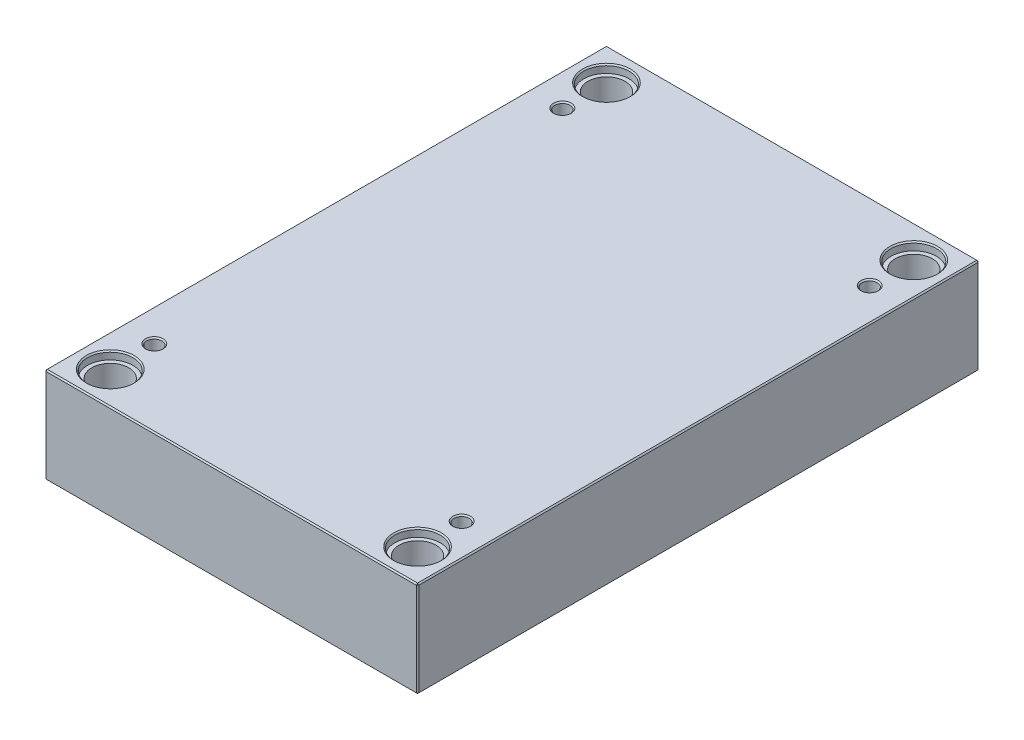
ISO-10303-21;
HEADER;
FILE_DESCRIPTION(('STEP AP214'),'2;1');
FILE_NAME('part.step','',(''),(''),'','','');
FILE_SCHEMA(('AUTOMOTIVE_DESIGN { 1 0 10303 214 1 1 1 1 }'));
ENDSEC;
DATA;
#1=APPLICATION_CONTEXT('core data for automotive mechanical design processes');
#2=APPLICATION_PROTOCOL_DEFINITION('international standard','automotive_design',2000,#1);
#3=PRODUCT_CONTEXT('',#1,'mechanical');
#4=PRODUCT('Part','Part','',(#3));
#5=PRODUCT_RELATED_PRODUCT_CATEGORY('part','',(#4));
#6=PRODUCT_DEFINITION_FORMATION('','',#4);
#7=PRODUCT_DEFINITION_CONTEXT('part definition',#1,'design');
#8=PRODUCT_DEFINITION('design','',#6,#7);
#9=PRODUCT_DEFINITION_SHAPE('','',#8);
#10=(LENGTH_UNIT() NAMED_UNIT(*) SI_UNIT(.MILLI.,.METRE.));
#11=(NAMED_UNIT(*) PLANE_ANGLE_UNIT() SI_UNIT($,.RADIAN.));
#12=(NAMED_UNIT(*) SI_UNIT($,.STERADIAN.) SOLID_ANGLE_UNIT());
#13=UNCERTAINTY_MEASURE_WITH_UNIT(LENGTH_MEASURE(1.E-05),#10,'distance_accuracy_value','');
#14=(GEOMETRIC_REPRESENTATION_CONTEXT(3) GLOBAL_UNCERTAINTY_ASSIGNED_CONTEXT((#13)) GLOBAL_UNIT_ASSIGNED_CONTEXT((#10,
#11,#12)) REPRESENTATION_CONTEXT('',''));
#15=CARTESIAN_POINT('',(0.,0.,0.));
#16=DIRECTION('',(0.,0.,1.));
#17=DIRECTION('',(1.,0.,0.));
#18=AXIS2_PLACEMENT_3D('',#15,#16,#17);
#19=CARTESIAN_POINT('',(-122.,0.,-197.));
#20=DIRECTION('',(0.,1.,0.));
#21=DIRECTION('',(0.,0.,1.));
#22=AXIS2_PLACEMENT_3D('',#19,#20,#21);
#23=CYLINDRICAL_SURFACE('',#22,14.7);
#24=CARTESIAN_POINT('',(-122.,1.00000000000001,-197.));
#25=DIRECTION('',(0.,1.,0.));
#26=DIRECTION('',(0.,0.,1.));
#27=AXIS2_PLACEMENT_3D('',#24,#25,#26);
#28=CIRCLE('',#27,14.7);
#29=CARTESIAN_POINT('',(-122.,1.00000000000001,-182.3));
#30=VERTEX_POINT('',#29);
#31=EDGE_CURVE('E472',#30,#30,#28,.F.);
#32=ORIENTED_EDGE('',*,*,#31,.T.);
#33=EDGE_LOOP('',(#32));
#34=FACE_BOUND('',#33,.T.);
#35=CARTESIAN_POINT('',(-122.,69.7,-197.));
#36=DIRECTION('',(0.,1.,0.));
#37=DIRECTION('',(0.,0.,1.));
#38=AXIS2_PLACEMENT_3D('',#35,#36,#37);
#39=CIRCLE('',#38,14.7);
#40=CARTESIAN_POINT('',(-122.,69.7,-182.3));
#41=VERTEX_POINT('',#40);
#42=EDGE_CURVE('E221',#41,#41,#39,.F.);
#43=ORIENTED_EDGE('',*,*,#42,.F.);
#44=EDGE_LOOP('',(#43));
#45=FACE_BOUND('',#44,.T.);
#46=ADVANCED_FACE('F16',(#34,#45),#23,.F.);
#47=CARTESIAN_POINT('',(122.,0.,-197.));
#48=DIRECTION('',(0.,1.,0.));
#49=DIRECTION('',(0.,0.,1.));
#50=AXIS2_PLACEMENT_3D('',#47,#48,#49);
#51=CYLINDRICAL_SURFACE('',#50,14.7);
#52=CARTESIAN_POINT('',(122.,1.00000000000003,-197.));
#53=DIRECTION('',(0.,1.,0.));
#54=DIRECTION('',(0.,0.,1.));
#55=AXIS2_PLACEMENT_3D('',#52,#53,#54);
#56=CIRCLE('',#55,14.7);
#57=CARTESIAN_POINT('',(122.,1.00000000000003,-182.3));
#58=VERTEX_POINT('',#57);
#59=EDGE_CURVE('E474',#58,#58,#56,.F.);
#60=ORIENTED_EDGE('',*,*,#59,.T.);
#61=EDGE_LOOP('',(#60));
#62=FACE_BOUND('',#61,.T.);
#63=CARTESIAN_POINT('',(122.,69.7,-197.));
#64=DIRECTION('',(0.,1.,0.));
#65=DIRECTION('',(0.,0.,1.));
#66=AXIS2_PLACEMENT_3D('',#63,#64,#65);
#67=CIRCLE('',#66,14.7);
#68=CARTESIAN_POINT('',(122.,69.7,-182.3));
#69=VERTEX_POINT('',#68);
#70=EDGE_CURVE('E218',#69,#69,#67,.F.);
#71=ORIENTED_EDGE('',*,*,#70,.F.);
#72=EDGE_LOOP('',(#71));
#73=FACE_BOUND('',#72,.T.);
#74=ADVANCED_FACE('F263',(#62,#73),#51,.F.);
#75=CARTESIAN_POINT('',(122.,0.,197.));
#76=DIRECTION('',(0.,1.,0.));
#77=DIRECTION('',(0.,0.,1.));
#78=AXIS2_PLACEMENT_3D('',#75,#76,#77);
#79=CYLINDRICAL_SURFACE('',#78,14.7);
#80=CARTESIAN_POINT('',(122.,1.00000000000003,197.));
#81=DIRECTION('',(0.,1.,0.));
#82=DIRECTION('',(0.,0.,1.));
#83=AXIS2_PLACEMENT_3D('',#80,#81,#82);
#84=CIRCLE('',#83,14.7);
#85=CARTESIAN_POINT('',(122.,1.00000000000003,211.7));
#86=VERTEX_POINT('',#85);
#87=EDGE_CURVE('E477',#86,#86,#84,.F.);
#88=ORIENTED_EDGE('',*,*,#87,.T.);
#89=EDGE_LOOP('',(#88));
#90=FACE_BOUND('',#89,.T.);
#91=CARTESIAN_POINT('',(122.,69.7,197.));
#92=DIRECTION('',(0.,1.,0.));
#93=DIRECTION('',(0.,0.,1.));
#94=AXIS2_PLACEMENT_3D('',#91,#92,#93);
#95=CIRCLE('',#94,14.7);
#96=CARTESIAN_POINT('',(122.,69.7,211.7));
#97=VERTEX_POINT('',#96);
#98=EDGE_CURVE('E214',#97,#97,#95,.F.);
#99=ORIENTED_EDGE('',*,*,#98,.F.);
#100=EDGE_LOOP('',(#99));
#101=FACE_BOUND('',#100,.T.);
#102=ADVANCED_FACE('F270',(#90,#101),#79,.F.);
#103=CARTESIAN_POINT('',(-122.,0.,197.));
#104=DIRECTION('',(0.,1.,0.));
#105=DIRECTION('',(0.,0.,1.));
#106=AXIS2_PLACEMENT_3D('',#103,#104,#105);
#107=CYLINDRICAL_SURFACE('',#106,14.7);
#108=CARTESIAN_POINT('',(-122.,1.00000000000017,197.));
#109=DIRECTION('',(0.,1.,0.));
#110=DIRECTION('',(0.,0.,1.));
#111=AXIS2_PLACEMENT_3D('',#108,#109,#110);
#112=CIRCLE('',#111,14.7);
#113=CARTESIAN_POINT('',(-122.,1.00000000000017,211.7));
#114=VERTEX_POINT('',#113);
#115=EDGE_CURVE('E480',#114,#114,#112,.F.);
#116=ORIENTED_EDGE('',*,*,#115,.T.);
#117=EDGE_LOOP('',(#116));
#118=FACE_BOUND('',#117,.T.);
#119=CARTESIAN_POINT('',(-122.,69.7,197.));
#120=DIRECTION('',(0.,1.,0.));
#121=DIRECTION('',(0.,0.,1.));
#122=AXIS2_PLACEMENT_3D('',#119,#120,#121);
#123=CIRCLE('',#122,14.7);
#124=CARTESIAN_POINT('',(-122.,69.7,211.7));
#125=VERTEX_POINT('',#124);
#126=EDGE_CURVE('E211',#125,#125,#123,.F.);
#127=ORIENTED_EDGE('',*,*,#126,.F.);
#128=EDGE_LOOP('',(#127));
#129=FACE_BOUND('',#128,.T.);
#130=ADVANCED_FACE('F277',(#118,#129),#107,.F.);
#131=CARTESIAN_POINT('',(-148.,76.,223.));
#132=DIRECTION('',(1.,0.,0.));
#133=DIRECTION('',(0.,0.,-1.));
#134=AXIS2_PLACEMENT_3D('',#131,#132,#133);
#135=PLANE('',#134);
#136=DIRECTION('',(0.,-1.,0.));
#137=VECTOR('',#136,1.);
#138=CARTESIAN_POINT('',(-148.,76.,-222.));
#139=LINE('',#138,#137);
#140=CARTESIAN_POINT('',(-148.,75.,-222.));
#141=VERTEX_POINT('',#140);
#142=CARTESIAN_POINT('',(-148.,1.,-222.));
#143=VERTEX_POINT('',#142);
#144=EDGE_CURVE('E487',#141,#143,#139,.T.);
#145=ORIENTED_EDGE('',*,*,#144,.T.);
#146=DIRECTION('',(0.,0.,1.));
#147=VECTOR('',#146,1.);
#148=CARTESIAN_POINT('',(-148.,1.,223.));
#149=LINE('',#148,#147);
#150=CARTESIAN_POINT('',(-148.,1.,222.));
#151=VERTEX_POINT('',#150);
#152=EDGE_CURVE('E490',#143,#151,#149,.T.);
#153=ORIENTED_EDGE('',*,*,#152,.T.);
#154=DIRECTION('',(0.,1.,0.));
#155=VECTOR('',#154,1.);
#156=CARTESIAN_POINT('',(-148.,76.,222.));
#157=LINE('',#156,#155);
#158=CARTESIAN_POINT('',(-148.,75.,222.));
#159=VERTEX_POINT('',#158);
#160=EDGE_CURVE('E485',#151,#159,#157,.T.);
#161=ORIENTED_EDGE('',*,*,#160,.T.);
#162=DIRECTION('',(0.,0.,-1.));
#163=VECTOR('',#162,1.);
#164=CARTESIAN_POINT('',(-148.,75.,-223.));
#165=LINE('',#164,#163);
#166=EDGE_CURVE('E483',#159,#141,#165,.T.);
#167=ORIENTED_EDGE('',*,*,#166,.T.);
#168=EDGE_LOOP('',(#145,#153,#161,#167));
#169=FACE_BOUND('',#168,.T.);
#170=ADVANCED_FACE('F298',(#169),#135,.F.);
#171=CARTESIAN_POINT('',(148.,76.,223.));
#172=DIRECTION('',(0.,0.,-1.));
#173=DIRECTION('',(-1.,0.,0.));
#174=AXIS2_PLACEMENT_3D('',#171,#172,#173);
#175=PLANE('',#174);
#176=DIRECTION('',(-1.,0.,0.));
#177=VECTOR('',#176,1.);
#178=CARTESIAN_POINT('',(-148.,75.,223.));
#179=LINE('',#178,#177);
#180=CARTESIAN_POINT('',(147.,75.,223.));
#181=VERTEX_POINT('',#180);
#182=CARTESIAN_POINT('',(-147.,75.,223.));
#183=VERTEX_POINT('',#182);
#184=EDGE_CURVE('E509',#181,#183,#179,.T.);
#185=ORIENTED_EDGE('',*,*,#184,.T.);
#186=DIRECTION('',(0.,-1.,0.));
#187=VECTOR('',#186,1.);
#188=CARTESIAN_POINT('',(-147.,76.,223.));
#189=LINE('',#188,#187);
#190=CARTESIAN_POINT('',(-147.,1.00000000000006,223.));
#191=VERTEX_POINT('',#190);
#192=EDGE_CURVE('E515',#183,#191,#189,.T.);
#193=ORIENTED_EDGE('',*,*,#192,.T.);
#194=DIRECTION('',(1.,0.,0.));
#195=VECTOR('',#194,1.);
#196=CARTESIAN_POINT('',(148.,1.00000000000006,223.));
#197=LINE('',#196,#195);
#198=CARTESIAN_POINT('',(147.,1.00000000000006,223.));
#199=VERTEX_POINT('',#198);
#200=EDGE_CURVE('E513',#191,#199,#197,.T.);
#201=ORIENTED_EDGE('',*,*,#200,.T.);
#202=DIRECTION('',(0.,1.,0.));
#203=VECTOR('',#202,1.);
#204=CARTESIAN_POINT('',(147.,76.,223.));
#205=LINE('',#204,#203);
#206=EDGE_CURVE('E511',#199,#181,#205,.T.);
#207=ORIENTED_EDGE('',*,*,#206,.T.);
#208=EDGE_LOOP('',(#185,#193,#201,#207));
#209=FACE_BOUND('',#208,.T.);
#210=ADVANCED_FACE('F294',(#209),#175,.F.);
#211=CARTESIAN_POINT('',(148.,76.,223.));
#212=DIRECTION('',(-1.,0.,0.));
#213=DIRECTION('',(0.,0.,1.));
#214=AXIS2_PLACEMENT_3D('',#211,#212,#213);
#215=PLANE('',#214);
#216=DIRECTION('',(0.,0.,-1.));
#217=VECTOR('',#216,1.);
#218=CARTESIAN_POINT('',(148.,1.00000000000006,223.));
#219=LINE('',#218,#217);
#220=CARTESIAN_POINT('',(148.,1.00000000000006,222.));
#221=VERTEX_POINT('',#220);
#222=CARTESIAN_POINT('',(148.,1.00000000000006,-222.));
#223=VERTEX_POINT('',#222);
#224=EDGE_CURVE('E504',#221,#223,#219,.T.);
#225=ORIENTED_EDGE('',*,*,#224,.T.);
#226=DIRECTION('',(0.,1.,0.));
#227=VECTOR('',#226,1.);
#228=CARTESIAN_POINT('',(148.,76.,-222.));
#229=LINE('',#228,#227);
#230=CARTESIAN_POINT('',(148.,75.,-222.));
#231=VERTEX_POINT('',#230);
#232=EDGE_CURVE('E506',#223,#231,#229,.T.);
#233=ORIENTED_EDGE('',*,*,#232,.T.);
#234=DIRECTION('',(0.,0.,1.));
#235=VECTOR('',#234,1.);
#236=CARTESIAN_POINT('',(148.,75.,223.));
#237=LINE('',#236,#235);
#238=CARTESIAN_POINT('',(148.,75.,222.));
#239=VERTEX_POINT('',#238);
#240=EDGE_CURVE('E500',#231,#239,#237,.T.);
#241=ORIENTED_EDGE('',*,*,#240,.T.);
#242=DIRECTION('',(0.,-1.,0.));
#243=VECTOR('',#242,1.);
#244=CARTESIAN_POINT('',(148.,76.,222.));
#245=LINE('',#244,#243);
#246=EDGE_CURVE('E502',#239,#221,#245,.T.);
#247=ORIENTED_EDGE('',*,*,#246,.T.);
#248=EDGE_LOOP('',(#225,#233,#241,#247));
#249=FACE_BOUND('',#248,.T.);
#250=ADVANCED_FACE('F290',(#249),#215,.F.);
#251=CARTESIAN_POINT('',(148.,76.,-223.));
#252=DIRECTION('',(0.,0.,1.));
#253=DIRECTION('',(1.,0.,0.));
#254=AXIS2_PLACEMENT_3D('',#251,#252,#253);
#255=PLANE('',#254);
#256=DIRECTION('',(0.,-1.,0.));
#257=VECTOR('',#256,1.);
#258=CARTESIAN_POINT('',(147.,76.,-223.));
#259=LINE('',#258,#257);
#260=CARTESIAN_POINT('',(147.,75.,-223.));
#261=VERTEX_POINT('',#260);
#262=CARTESIAN_POINT('',(147.,1.00000000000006,-223.));
#263=VERTEX_POINT('',#262);
#264=EDGE_CURVE('E494',#261,#263,#259,.T.);
#265=ORIENTED_EDGE('',*,*,#264,.T.);
#266=DIRECTION('',(-1.,0.,0.));
#267=VECTOR('',#266,1.);
#268=CARTESIAN_POINT('',(148.,1.00000000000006,-223.));
#269=LINE('',#268,#267);
#270=CARTESIAN_POINT('',(-147.,1.00000000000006,-223.));
#271=VERTEX_POINT('',#270);
#272=EDGE_CURVE('E138',#263,#271,#269,.T.);
#273=ORIENTED_EDGE('',*,*,#272,.T.);
#274=DIRECTION('',(0.,1.,0.));
#275=VECTOR('',#274,1.);
#276=CARTESIAN_POINT('',(-147.,76.,-223.));
#277=LINE('',#276,#275);
#278=CARTESIAN_POINT('',(-147.,75.,-223.));
#279=VERTEX_POINT('',#278);
#280=EDGE_CURVE('E496',#271,#279,#277,.T.);
#281=ORIENTED_EDGE('',*,*,#280,.T.);
#282=DIRECTION('',(1.,0.,0.));
#283=VECTOR('',#282,1.);
#284=CARTESIAN_POINT('',(148.,75.,-223.));
#285=LINE('',#284,#283);
#286=EDGE_CURVE('E492',#279,#261,#285,.T.);
#287=ORIENTED_EDGE('',*,*,#286,.T.);
#288=EDGE_LOOP('',(#265,#273,#281,#287));
#289=FACE_BOUND('',#288,.T.);
#290=ADVANCED_FACE('F282',(#289),#255,.F.);
#291=CARTESIAN_POINT('',(0.,76.,0.));
#292=DIRECTION('',(0.,1.,0.));
#293=DIRECTION('',(0.,0.,1.));
#294=AXIS2_PLACEMENT_3D('',#291,#292,#293);
#295=PLANE('',#294);
#296=CARTESIAN_POINT('',(122.,76.,197.));
#297=DIRECTION('',(0.,1.,0.));
#298=DIRECTION('',(0.,0.,1.));
#299=AXIS2_PLACEMENT_3D('',#296,#297,#298);
#300=CIRCLE('',#299,19.);
#301=CARTESIAN_POINT('',(122.,76.,216.));
#302=VERTEX_POINT('',#301);
#303=EDGE_CURVE('E236',#302,#302,#300,.F.);
#304=ORIENTED_EDGE('',*,*,#303,.T.);
#305=EDGE_LOOP('',(#304));
#306=FACE_BOUND('',#305,.T.);
#307=CARTESIAN_POINT('',(-122.,76.,197.));
#308=DIRECTION('',(0.,1.,0.));
#309=DIRECTION('',(0.,0.,1.));
#310=AXIS2_PLACEMENT_3D('',#307,#308,#309);
#311=CIRCLE('',#310,19.);
#312=CARTESIAN_POINT('',(-122.,76.,216.));
#313=VERTEX_POINT('',#312);
#314=EDGE_CURVE('E233',#313,#313,#311,.F.);
#315=ORIENTED_EDGE('',*,*,#314,.T.);
#316=EDGE_LOOP('',(#315));
#317=FACE_BOUND('',#316,.T.);
#318=CARTESIAN_POINT('',(122.,76.,-197.));
#319=DIRECTION('',(0.,1.,0.));
#320=DIRECTION('',(0.,0.,1.));
#321=AXIS2_PLACEMENT_3D('',#318,#319,#320);
#322=CIRCLE('',#321,19.);
#323=CARTESIAN_POINT('',(122.,76.,-178.));
#324=VERTEX_POINT('',#323);
#325=EDGE_CURVE('E230',#324,#324,#322,.F.);
#326=ORIENTED_EDGE('',*,*,#325,.T.);
#327=EDGE_LOOP('',(#326));
#328=FACE_BOUND('',#327,.T.);
#329=CARTESIAN_POINT('',(-122.,76.,-197.));
#330=DIRECTION('',(0.,1.,0.));
#331=DIRECTION('',(0.,0.,1.));
#332=AXIS2_PLACEMENT_3D('',#329,#330,#331);
#333=CIRCLE('',#332,19.);
#334=CARTESIAN_POINT('',(-122.,76.,-178.));
#335=VERTEX_POINT('',#334);
#336=EDGE_CURVE('E227',#335,#335,#333,.F.);
#337=ORIENTED_EDGE('',*,*,#336,.T.);
#338=EDGE_LOOP('',(#337));
#339=FACE_BOUND('',#338,.T.);
#340=CARTESIAN_POINT('',(-122.,76.,162.));
#341=DIRECTION('',(0.,1.,0.));
#342=DIRECTION('',(0.,0.,1.));
#343=AXIS2_PLACEMENT_3D('',#340,#341,#342);
#344=CIRCLE('',#343,7.);
#345=CARTESIAN_POINT('',(-122.,76.,169.));
#346=VERTEX_POINT('',#345);
#347=EDGE_CURVE('E198',#346,#346,#344,.F.);
#348=ORIENTED_EDGE('',*,*,#347,.T.);
#349=EDGE_LOOP('',(#348));
#350=FACE_BOUND('',#349,.T.);
#351=CARTESIAN_POINT('',(122.,76.,162.));
#352=DIRECTION('',(0.,1.,0.));
#353=DIRECTION('',(0.,0.,1.));
#354=AXIS2_PLACEMENT_3D('',#351,#352,#353);
#355=CIRCLE('',#354,7.00000000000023);
#356=CARTESIAN_POINT('',(122.,76.,169.));
#357=VERTEX_POINT('',#356);
#358=EDGE_CURVE('E195',#357,#357,#355,.F.);
#359=ORIENTED_EDGE('',*,*,#358,.T.);
#360=EDGE_LOOP('',(#359));
#361=FACE_BOUND('',#360,.T.);
#362=CARTESIAN_POINT('',(122.,76.,-162.));
#363=DIRECTION('',(0.,1.,0.));
#364=DIRECTION('',(0.,0.,1.));
#365=AXIS2_PLACEMENT_3D('',#362,#363,#364);
#366=CIRCLE('',#365,7.00000000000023);
#367=CARTESIAN_POINT('',(122.,76.,-155.));
#368=VERTEX_POINT('',#367);
#369=EDGE_CURVE('E192',#368,#368,#366,.F.);
#370=ORIENTED_EDGE('',*,*,#369,.T.);
#371=EDGE_LOOP('',(#370));
#372=FACE_BOUND('',#371,.T.);
#373=CARTESIAN_POINT('',(-122.,76.,-162.));
#374=DIRECTION('',(0.,1.,0.));
#375=DIRECTION('',(0.,0.,1.));
#376=AXIS2_PLACEMENT_3D('',#373,#374,#375);
#377=CIRCLE('',#376,7.);
#378=CARTESIAN_POINT('',(-122.,76.,-155.));
#379=VERTEX_POINT('',#378);
#380=EDGE_CURVE('E188',#379,#379,#377,.F.);
#381=ORIENTED_EDGE('',*,*,#380,.T.);
#382=EDGE_LOOP('',(#381));
#383=FACE_BOUND('',#382,.T.);
#384=DIRECTION('',(0.,0.,-1.));
#385=VECTOR('',#384,1.);
#386=CARTESIAN_POINT('',(147.,76.,-223.));
#387=LINE('',#386,#385);
#388=CARTESIAN_POINT('',(147.,76.,222.));
#389=VERTEX_POINT('',#388);
#390=CARTESIAN_POINT('',(147.,76.,-222.));
#391=VERTEX_POINT('',#390);
#392=EDGE_CURVE('E31',#389,#391,#387,.T.);
#393=ORIENTED_EDGE('',*,*,#392,.T.);
#394=DIRECTION('',(-1.,0.,0.));
#395=VECTOR('',#394,1.);
#396=CARTESIAN_POINT('',(-148.,76.,-222.));
#397=LINE('',#396,#395);
#398=CARTESIAN_POINT('',(-147.,76.,-222.));
#399=VERTEX_POINT('',#398);
#400=EDGE_CURVE('E189',#391,#399,#397,.T.);
#401=ORIENTED_EDGE('',*,*,#400,.T.);
#402=DIRECTION('',(0.,0.,1.));
#403=VECTOR('',#402,1.);
#404=CARTESIAN_POINT('',(-147.,76.,223.));
#405=LINE('',#404,#403);
#406=CARTESIAN_POINT('',(-147.,76.,222.));
#407=VERTEX_POINT('',#406);
#408=EDGE_CURVE('E518',#399,#407,#405,.T.);
#409=ORIENTED_EDGE('',*,*,#408,.T.);
#410=DIRECTION('',(1.,0.,0.));
#411=VECTOR('',#410,1.);
#412=CARTESIAN_POINT('',(148.,76.,222.));
#413=LINE('',#412,#411);
#414=EDGE_CURVE('E36',#407,#389,#413,.T.);
#415=ORIENTED_EDGE('',*,*,#414,.T.);
#416=EDGE_LOOP('',(#393,#401,#409,#415));
#417=FACE_BOUND('',#416,.T.);
#418=ADVANCED_FACE('F279',(#306,#317,#328,#339,#350,#361,#372,#383,#417),#295,.T.);
#419=CARTESIAN_POINT('',(0.,0.,0.));
#420=DIRECTION('',(0.,1.,0.));
#421=DIRECTION('',(0.,0.,1.));
#422=AXIS2_PLACEMENT_3D('',#419,#420,#421);
#423=PLANE('',#422);
#424=CARTESIAN_POINT('',(-122.,0.,-197.));
#425=DIRECTION('',(0.,1.,0.));
#426=DIRECTION('',(0.,0.,1.));
#427=AXIS2_PLACEMENT_3D('',#424,#425,#426);
#428=CIRCLE('',#427,15.7);
#429=CARTESIAN_POINT('',(-122.,0.,-181.3));
#430=VERTEX_POINT('',#429);
#431=EDGE_CURVE('E469',#430,#430,#428,.T.);
#432=ORIENTED_EDGE('',*,*,#431,.T.);
#433=EDGE_LOOP('',(#432));
#434=FACE_BOUND('',#433,.T.);
#435=CARTESIAN_POINT('',(122.,0.,-197.));
#436=DIRECTION('',(0.,1.,0.));
#437=DIRECTION('',(0.,0.,1.));
#438=AXIS2_PLACEMENT_3D('',#435,#436,#437);
#439=CIRCLE('',#438,15.7);
#440=CARTESIAN_POINT('',(122.,0.,-181.3));
#441=VERTEX_POINT('',#440);
#442=EDGE_CURVE('E466',#441,#441,#439,.T.);
#443=ORIENTED_EDGE('',*,*,#442,.T.);
#444=EDGE_LOOP('',(#443));
#445=FACE_BOUND('',#444,.T.);
#446=CARTESIAN_POINT('',(122.,0.,197.));
#447=DIRECTION('',(0.,1.,0.));
#448=DIRECTION('',(0.,0.,1.));
#449=AXIS2_PLACEMENT_3D('',#446,#447,#448);
#450=CIRCLE('',#449,15.7);
#451=CARTESIAN_POINT('',(122.,0.,212.7));
#452=VERTEX_POINT('',#451);
#453=EDGE_CURVE('E463',#452,#452,#450,.T.);
#454=ORIENTED_EDGE('',*,*,#453,.T.);
#455=EDGE_LOOP('',(#454));
#456=FACE_BOUND('',#455,.T.);
#457=CARTESIAN_POINT('',(-122.,0.,197.));
#458=DIRECTION('',(0.,1.,0.));
#459=DIRECTION('',(0.,0.,1.));
#460=AXIS2_PLACEMENT_3D('',#457,#458,#459);
#461=CIRCLE('',#460,15.7);
#462=CARTESIAN_POINT('',(-122.,0.,212.7));
#463=VERTEX_POINT('',#462);
#464=EDGE_CURVE('E460',#463,#463,#461,.T.);
#465=ORIENTED_EDGE('',*,*,#464,.T.);
#466=EDGE_LOOP('',(#465));
#467=FACE_BOUND('',#466,.T.);
#468=DIRECTION('',(0.,0.,1.));
#469=VECTOR('',#468,1.);
#470=CARTESIAN_POINT('',(147.,0.,0.));
#471=LINE('',#470,#469);
#472=CARTESIAN_POINT('',(147.,0.,-222.));
#473=VERTEX_POINT('',#472);
#474=CARTESIAN_POINT('',(147.,0.,222.));
#475=VERTEX_POINT('',#474);
#476=EDGE_CURVE('E108',#473,#475,#471,.T.);
#477=ORIENTED_EDGE('',*,*,#476,.T.);
#478=DIRECTION('',(-1.,0.,0.));
#479=VECTOR('',#478,1.);
#480=CARTESIAN_POINT('',(0.,0.,222.));
#481=LINE('',#480,#479);
#482=CARTESIAN_POINT('',(-147.,0.,222.));
#483=VERTEX_POINT('',#482);
#484=EDGE_CURVE('E458',#475,#483,#481,.T.);
#485=ORIENTED_EDGE('',*,*,#484,.T.);
#486=DIRECTION('',(0.,0.,-1.));
#487=VECTOR('',#486,1.);
#488=CARTESIAN_POINT('',(-147.,0.,0.));
#489=LINE('',#488,#487);
#490=CARTESIAN_POINT('',(-147.,0.,-222.));
#491=VERTEX_POINT('',#490);
#492=EDGE_CURVE('E110',#483,#491,#489,.T.);
#493=ORIENTED_EDGE('',*,*,#492,.T.);
#494=DIRECTION('',(1.,0.,0.));
#495=VECTOR('',#494,1.);
#496=CARTESIAN_POINT('',(0.,0.,-222.));
#497=LINE('',#496,#495);
#498=EDGE_CURVE('E104',#491,#473,#497,.T.);
#499=ORIENTED_EDGE('',*,*,#498,.T.);
#500=EDGE_LOOP('',(#477,#485,#493,#499));
#501=FACE_BOUND('',#500,.T.);
#502=ADVANCED_FACE('F106',(#434,#445,#456,#467,#501),#423,.F.);
#503=CARTESIAN_POINT('',(-122.,0.,-197.));
#504=DIRECTION('',(0.,-1.,0.));
#505=DIRECTION('',(0.,0.,-1.));
#506=AXIS2_PLACEMENT_3D('',#503,#504,#505);
#507=CONICAL_SURFACE('',#506,15.7,0.78539816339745);
#508=ORIENTED_EDGE('',*,*,#31,.F.);
#509=EDGE_LOOP('',(#508));
#510=FACE_BOUND('',#509,.T.);
#511=ORIENTED_EDGE('',*,*,#431,.F.);
#512=EDGE_LOOP('',(#511));
#513=FACE_BOUND('',#512,.T.);
#514=ADVANCED_FACE('F286',(#510,#513),#507,.F.);
#515=CARTESIAN_POINT('',(122.,0.,-197.));
#516=DIRECTION('',(0.,-1.,0.));
#517=DIRECTION('',(0.,0.,-1.));
#518=AXIS2_PLACEMENT_3D('',#515,#516,#517);
#519=CONICAL_SURFACE('',#518,15.7,0.78539816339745);
#520=ORIENTED_EDGE('',*,*,#59,.F.);
#521=EDGE_LOOP('',(#520));
#522=FACE_BOUND('',#521,.T.);
#523=ORIENTED_EDGE('',*,*,#442,.F.);
#524=EDGE_LOOP('',(#523));
#525=FACE_BOUND('',#524,.T.);
#526=ADVANCED_FACE('F305',(#522,#525),#519,.F.);
#527=CARTESIAN_POINT('',(122.,0.,197.));
#528=DIRECTION('',(0.,-1.,0.));
#529=DIRECTION('',(0.,0.,-1.));
#530=AXIS2_PLACEMENT_3D('',#527,#528,#529);
#531=CONICAL_SURFACE('',#530,15.7,0.78539816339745);
#532=ORIENTED_EDGE('',*,*,#87,.F.);
#533=EDGE_LOOP('',(#532));
#534=FACE_BOUND('',#533,.T.);
#535=ORIENTED_EDGE('',*,*,#453,.F.);
#536=EDGE_LOOP('',(#535));
#537=FACE_BOUND('',#536,.T.);
#538=ADVANCED_FACE('F309',(#534,#537),#531,.F.);
#539=CARTESIAN_POINT('',(-122.,0.,197.));
#540=DIRECTION('',(0.,-1.,0.));
#541=DIRECTION('',(0.,0.,-1.));
#542=AXIS2_PLACEMENT_3D('',#539,#540,#541);
#543=CONICAL_SURFACE('',#542,15.7,0.78539816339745);
#544=ORIENTED_EDGE('',*,*,#115,.F.);
#545=EDGE_LOOP('',(#544));
#546=FACE_BOUND('',#545,.T.);
#547=ORIENTED_EDGE('',*,*,#464,.F.);
#548=EDGE_LOOP('',(#547));
#549=FACE_BOUND('',#548,.T.);
#550=ADVANCED_FACE('F313',(#546,#549),#543,.F.);
#551=CARTESIAN_POINT('',(148.,76.,222.));
#552=DIRECTION('',(-0.707106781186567,0.,-0.707106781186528));
#553=DIRECTION('',(0.,-1.,0.));
#554=AXIS2_PLACEMENT_3D('',#551,#552,#553);
#555=PLANE('',#554);
#556=DIRECTION('',(-0.707106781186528,0.,0.707106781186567));
#557=VECTOR('',#556,1.);
#558=CARTESIAN_POINT('',(147.,75.,223.));
#559=LINE('',#558,#557);
#560=EDGE_CURVE('E126',#181,#239,#559,.F.);
#561=ORIENTED_EDGE('',*,*,#560,.F.);
#562=ORIENTED_EDGE('',*,*,#206,.F.);
#563=DIRECTION('',(0.707106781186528,0.,-0.707106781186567));
#564=VECTOR('',#563,1.);
#565=CARTESIAN_POINT('',(147.,1.00000000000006,223.));
#566=LINE('',#565,#564);
#567=EDGE_CURVE('E180',#221,#199,#566,.F.);
#568=ORIENTED_EDGE('',*,*,#567,.F.);
#569=ORIENTED_EDGE('',*,*,#246,.F.);
#570=EDGE_LOOP('',(#561,#562,#568,#569));
#571=FACE_BOUND('',#570,.T.);
#572=ADVANCED_FACE('F317',(#571),#555,.F.);
#573=CARTESIAN_POINT('',(147.,75.,223.));
#574=DIRECTION('',(0.577350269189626,0.577350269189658,0.577350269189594));
#575=DIRECTION('',(-0.707106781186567,0.707106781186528,0.));
#576=AXIS2_PLACEMENT_3D('',#573,#574,#575);
#577=PLANE('',#576);
#578=DIRECTION('',(0.,-0.707106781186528,0.707106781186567));
#579=VECTOR('',#578,1.);
#580=CARTESIAN_POINT('',(147.,75.,223.));
#581=LINE('',#580,#579);
#582=EDGE_CURVE('E175',#181,#389,#581,.F.);
#583=ORIENTED_EDGE('',*,*,#582,.F.);
#584=ORIENTED_EDGE('',*,*,#560,.T.);
#585=DIRECTION('',(-0.707106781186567,0.707106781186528,0.));
#586=VECTOR('',#585,1.);
#587=CARTESIAN_POINT('',(147.5,75.5,222.));
#588=LINE('',#587,#586);
#589=EDGE_CURVE('E177',#389,#239,#588,.F.);
#590=ORIENTED_EDGE('',*,*,#589,.F.);
#591=EDGE_LOOP('',(#583,#584,#590));
#592=FACE_BOUND('',#591,.T.);
#593=ADVANCED_FACE('F385',(#592),#577,.T.);
#594=CARTESIAN_POINT('',(147.,1.00000000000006,223.));
#595=DIRECTION('',(0.577350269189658,-0.577350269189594,0.577350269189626));
#596=DIRECTION('',(0.707106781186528,0.,-0.707106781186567));
#597=AXIS2_PLACEMENT_3D('',#594,#595,#596);
#598=PLANE('',#597);
#599=DIRECTION('',(-0.707106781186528,-0.707106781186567,0.));
#600=VECTOR('',#599,1.);
#601=CARTESIAN_POINT('',(147.5,0.500000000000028,222.));
#602=LINE('',#601,#600);
#603=EDGE_CURVE('E124',#221,#475,#602,.T.);
#604=ORIENTED_EDGE('',*,*,#603,.F.);
#605=ORIENTED_EDGE('',*,*,#567,.T.);
#606=DIRECTION('',(0.,0.707106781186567,0.707106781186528));
#607=VECTOR('',#606,1.);
#608=CARTESIAN_POINT('',(147.,1.00000000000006,223.));
#609=LINE('',#608,#607);
#610=EDGE_CURVE('E172',#475,#199,#609,.T.);
#611=ORIENTED_EDGE('',*,*,#610,.F.);
#612=EDGE_LOOP('',(#604,#605,#611));
#613=FACE_BOUND('',#612,.T.);
#614=ADVANCED_FACE('F381',(#613),#598,.T.);
#615=CARTESIAN_POINT('',(147.,76.,0.));
#616=DIRECTION('',(0.707106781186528,0.707106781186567,0.));
#617=DIRECTION('',(0.,0.,1.));
#618=AXIS2_PLACEMENT_3D('',#615,#616,#617);
#619=PLANE('',#618);
#620=ORIENTED_EDGE('',*,*,#589,.T.);
#621=ORIENTED_EDGE('',*,*,#240,.F.);
#622=DIRECTION('',(0.707106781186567,-0.707106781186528,0.));
#623=VECTOR('',#622,1.);
#624=CARTESIAN_POINT('',(148.,75.,-222.));
#625=LINE('',#624,#623);
#626=EDGE_CURVE('E166',#391,#231,#625,.T.);
#627=ORIENTED_EDGE('',*,*,#626,.F.);
#628=ORIENTED_EDGE('',*,*,#392,.F.);
#629=EDGE_LOOP('',(#620,#621,#627,#628));
#630=FACE_BOUND('',#629,.T.);
#631=ADVANCED_FACE('F377',(#630),#619,.T.);
#632=CARTESIAN_POINT('',(0.,76.,222.));
#633=DIRECTION('',(0.,0.707106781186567,0.707106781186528));
#634=DIRECTION('',(-1.,0.,0.));
#635=AXIS2_PLACEMENT_3D('',#632,#633,#634);
#636=PLANE('',#635);
#637=ORIENTED_EDGE('',*,*,#582,.T.);
#638=ORIENTED_EDGE('',*,*,#414,.F.);
#639=DIRECTION('',(0.,0.707106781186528,-0.707106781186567));
#640=VECTOR('',#639,1.);
#641=CARTESIAN_POINT('',(-147.,75.5,222.5));
#642=LINE('',#641,#640);
#643=EDGE_CURVE('E163',#183,#407,#642,.T.);
#644=ORIENTED_EDGE('',*,*,#643,.F.);
#645=ORIENTED_EDGE('',*,*,#184,.F.);
#646=EDGE_LOOP('',(#637,#638,#644,#645));
#647=FACE_BOUND('',#646,.T.);
#648=ADVANCED_FACE('F373',(#647),#636,.T.);
#649=CARTESIAN_POINT('',(-147.,76.,223.));
#650=DIRECTION('',(0.707106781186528,0.,-0.707106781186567));
#651=DIRECTION('',(0.,-1.,0.));
#652=AXIS2_PLACEMENT_3D('',#649,#650,#651);
#653=PLANE('',#652);
#654=DIRECTION('',(0.707106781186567,0.,0.707106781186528));
#655=VECTOR('',#654,1.);
#656=CARTESIAN_POINT('',(-147.,1.00000000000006,223.));
#657=LINE('',#656,#655);
#658=EDGE_CURVE('E157',#191,#151,#657,.F.);
#659=ORIENTED_EDGE('',*,*,#658,.F.);
#660=ORIENTED_EDGE('',*,*,#192,.F.);
#661=DIRECTION('',(-0.707106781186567,0.,-0.707106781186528));
#662=VECTOR('',#661,1.);
#663=CARTESIAN_POINT('',(-148.,75.,222.));
#664=LINE('',#663,#662);
#665=EDGE_CURVE('E160',#159,#183,#664,.F.);
#666=ORIENTED_EDGE('',*,*,#665,.F.);
#667=ORIENTED_EDGE('',*,*,#160,.F.);
#668=EDGE_LOOP('',(#659,#660,#666,#667));
#669=FACE_BOUND('',#668,.T.);
#670=ADVANCED_FACE('F369',(#669),#653,.F.);
#671=CARTESIAN_POINT('',(148.,1.00000000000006,223.));
#672=DIRECTION('',(0.,0.707106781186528,-0.707106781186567));
#673=DIRECTION('',(1.,0.,0.));
#674=AXIS2_PLACEMENT_3D('',#671,#672,#673);
#675=PLANE('',#674);
#676=ORIENTED_EDGE('',*,*,#610,.T.);
#677=ORIENTED_EDGE('',*,*,#200,.F.);
#678=DIRECTION('',(0.,-0.707106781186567,-0.707106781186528));
#679=VECTOR('',#678,1.);
#680=CARTESIAN_POINT('',(-147.,1.00000000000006,223.));
#681=LINE('',#680,#679);
#682=EDGE_CURVE('E135',#483,#191,#681,.F.);
#683=ORIENTED_EDGE('',*,*,#682,.F.);
#684=ORIENTED_EDGE('',*,*,#484,.F.);
#685=EDGE_LOOP('',(#676,#677,#683,#684));
#686=FACE_BOUND('',#685,.T.);
#687=ADVANCED_FACE('F366',(#686),#675,.F.);
#688=CARTESIAN_POINT('',(148.,1.00000000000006,223.));
#689=DIRECTION('',(-0.707106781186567,0.707106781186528,0.));
#690=DIRECTION('',(0.,0.,-1.));
#691=AXIS2_PLACEMENT_3D('',#688,#689,#690);
#692=PLANE('',#691);
#693=ORIENTED_EDGE('',*,*,#603,.T.);
#694=ORIENTED_EDGE('',*,*,#476,.F.);
#695=DIRECTION('',(0.707106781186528,0.707106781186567,0.));
#696=VECTOR('',#695,1.);
#697=CARTESIAN_POINT('',(147.5,0.500000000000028,-222.));
#698=LINE('',#697,#696);
#699=EDGE_CURVE('E121',#223,#473,#698,.F.);
#700=ORIENTED_EDGE('',*,*,#699,.F.);
#701=ORIENTED_EDGE('',*,*,#224,.F.);
#702=EDGE_LOOP('',(#693,#694,#700,#701));
#703=FACE_BOUND('',#702,.T.);
#704=ADVANCED_FACE('F119',(#703),#692,.F.);
#705=CARTESIAN_POINT('',(147.,76.,-223.));
#706=DIRECTION('',(-0.707106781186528,0.,0.707106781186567));
#707=DIRECTION('',(0.,-1.,0.));
#708=AXIS2_PLACEMENT_3D('',#705,#706,#707);
#709=PLANE('',#708);
#710=DIRECTION('',(0.707106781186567,0.,0.707106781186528));
#711=VECTOR('',#710,1.);
#712=CARTESIAN_POINT('',(148.,75.,-222.));
#713=LINE('',#712,#711);
#714=EDGE_CURVE('E168',#231,#261,#713,.F.);
#715=ORIENTED_EDGE('',*,*,#714,.F.);
#716=ORIENTED_EDGE('',*,*,#232,.F.);
#717=DIRECTION('',(-0.707106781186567,0.,-0.707106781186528));
#718=VECTOR('',#717,1.);
#719=CARTESIAN_POINT('',(147.,1.00000000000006,-223.));
#720=LINE('',#719,#718);
#721=EDGE_CURVE('E134',#263,#223,#720,.F.);
#722=ORIENTED_EDGE('',*,*,#721,.F.);
#723=ORIENTED_EDGE('',*,*,#264,.F.);
#724=EDGE_LOOP('',(#715,#716,#722,#723));
#725=FACE_BOUND('',#724,.T.);
#726=ADVANCED_FACE('F359',(#725),#709,.F.);
#727=CARTESIAN_POINT('',(148.,75.,-222.));
#728=DIRECTION('',(0.577350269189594,0.577350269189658,-0.577350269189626));
#729=DIRECTION('',(0.,0.707106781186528,0.707106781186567));
#730=AXIS2_PLACEMENT_3D('',#727,#728,#729);
#731=PLANE('',#730);
#732=ORIENTED_EDGE('',*,*,#626,.T.);
#733=ORIENTED_EDGE('',*,*,#714,.T.);
#734=DIRECTION('',(0.,0.707106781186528,0.707106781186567));
#735=VECTOR('',#734,1.);
#736=CARTESIAN_POINT('',(147.,75.5,-222.5));
#737=LINE('',#736,#735);
#738=EDGE_CURVE('E152',#391,#261,#737,.F.);
#739=ORIENTED_EDGE('',*,*,#738,.F.);
#740=EDGE_LOOP('',(#732,#733,#739));
#741=FACE_BOUND('',#740,.T.);
#742=ADVANCED_FACE('F355',(#741),#731,.T.);
#743=CARTESIAN_POINT('',(-148.,75.,222.));
#744=DIRECTION('',(-0.577350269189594,0.577350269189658,0.577350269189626));
#745=DIRECTION('',(0.,-0.707106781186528,0.707106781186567));
#746=AXIS2_PLACEMENT_3D('',#743,#744,#745);
#747=PLANE('',#746);
#748=ORIENTED_EDGE('',*,*,#665,.T.);
#749=ORIENTED_EDGE('',*,*,#643,.T.);
#750=DIRECTION('',(-0.707106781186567,-0.707106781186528,0.));
#751=VECTOR('',#750,1.);
#752=CARTESIAN_POINT('',(-148.,75.,222.));
#753=LINE('',#752,#751);
#754=EDGE_CURVE('E143',#159,#407,#753,.F.);
#755=ORIENTED_EDGE('',*,*,#754,.F.);
#756=EDGE_LOOP('',(#748,#749,#755));
#757=FACE_BOUND('',#756,.T.);
#758=ADVANCED_FACE('F351',(#757),#747,.T.);
#759=CARTESIAN_POINT('',(-147.,1.00000000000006,223.));
#760=DIRECTION('',(-0.577350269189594,-0.577350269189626,0.577350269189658));
#761=DIRECTION('',(0.,-0.707106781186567,-0.707106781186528));
#762=AXIS2_PLACEMENT_3D('',#759,#760,#761);
#763=PLANE('',#762);
#764=ORIENTED_EDGE('',*,*,#682,.T.);
#765=ORIENTED_EDGE('',*,*,#658,.T.);
#766=DIRECTION('',(-0.707106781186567,0.707106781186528,0.));
#767=VECTOR('',#766,1.);
#768=CARTESIAN_POINT('',(-147.5,0.5,222.));
#769=LINE('',#768,#767);
#770=EDGE_CURVE('E139',#483,#151,#769,.T.);
#771=ORIENTED_EDGE('',*,*,#770,.F.);
#772=EDGE_LOOP('',(#764,#765,#771));
#773=FACE_BOUND('',#772,.T.);
#774=ADVANCED_FACE('F348',(#773),#763,.T.);
#775=CARTESIAN_POINT('',(147.,1.00000000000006,-223.));
#776=DIRECTION('',(0.577350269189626,-0.577350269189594,-0.577350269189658));
#777=DIRECTION('',(-0.707106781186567,0.,-0.707106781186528));
#778=AXIS2_PLACEMENT_3D('',#775,#776,#777);
#779=PLANE('',#778);
#780=ORIENTED_EDGE('',*,*,#721,.T.);
#781=ORIENTED_EDGE('',*,*,#699,.T.);
#782=DIRECTION('',(0.,-0.707106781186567,0.707106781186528));
#783=VECTOR('',#782,1.);
#784=CARTESIAN_POINT('',(147.,1.00000000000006,-223.));
#785=LINE('',#784,#783);
#786=EDGE_CURVE('E131',#263,#473,#785,.T.);
#787=ORIENTED_EDGE('',*,*,#786,.F.);
#788=EDGE_LOOP('',(#780,#781,#787));
#789=FACE_BOUND('',#788,.T.);
#790=ADVANCED_FACE('F130',(#789),#779,.T.);
#791=CARTESIAN_POINT('',(0.,76.,-222.));
#792=DIRECTION('',(0.,0.707106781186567,-0.707106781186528));
#793=DIRECTION('',(1.,0.,0.));
#794=AXIS2_PLACEMENT_3D('',#791,#792,#793);
#795=PLANE('',#794);
#796=ORIENTED_EDGE('',*,*,#738,.T.);
#797=ORIENTED_EDGE('',*,*,#286,.F.);
#798=DIRECTION('',(0.,-0.707106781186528,-0.707106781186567));
#799=VECTOR('',#798,1.);
#800=CARTESIAN_POINT('',(-147.,75.,-223.));
#801=LINE('',#800,#799);
#802=EDGE_CURVE('E140',#399,#279,#801,.T.);
#803=ORIENTED_EDGE('',*,*,#802,.F.);
#804=ORIENTED_EDGE('',*,*,#400,.F.);
#805=EDGE_LOOP('',(#796,#797,#803,#804));
#806=FACE_BOUND('',#805,.T.);
#807=ADVANCED_FACE('F341',(#806),#795,.T.);
#808=CARTESIAN_POINT('',(-147.,76.,0.));
#809=DIRECTION('',(-0.707106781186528,0.707106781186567,0.));
#810=DIRECTION('',(0.,0.,-1.));
#811=AXIS2_PLACEMENT_3D('',#808,#809,#810);
#812=PLANE('',#811);
#813=ORIENTED_EDGE('',*,*,#754,.T.);
#814=ORIENTED_EDGE('',*,*,#408,.F.);
#815=DIRECTION('',(0.707106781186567,0.707106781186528,0.));
#816=VECTOR('',#815,1.);
#817=CARTESIAN_POINT('',(-147.5,75.5,-222.));
#818=LINE('',#817,#816);
#819=EDGE_CURVE('E146',#141,#399,#818,.T.);
#820=ORIENTED_EDGE('',*,*,#819,.F.);
#821=ORIENTED_EDGE('',*,*,#166,.F.);
#822=EDGE_LOOP('',(#813,#814,#820,#821));
#823=FACE_BOUND('',#822,.T.);
#824=ADVANCED_FACE('F337',(#823),#812,.T.);
#825=CARTESIAN_POINT('',(-148.,1.,223.));
#826=DIRECTION('',(0.707106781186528,0.707106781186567,0.));
#827=DIRECTION('',(0.,0.,1.));
#828=AXIS2_PLACEMENT_3D('',#825,#826,#827);
#829=PLANE('',#828);
#830=ORIENTED_EDGE('',*,*,#770,.T.);
#831=ORIENTED_EDGE('',*,*,#152,.F.);
#832=DIRECTION('',(0.707106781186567,-0.707106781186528,0.));
#833=VECTOR('',#832,1.);
#834=CARTESIAN_POINT('',(-148.,1.,-222.));
#835=LINE('',#834,#833);
#836=EDGE_CURVE('E529',#491,#143,#835,.F.);
#837=ORIENTED_EDGE('',*,*,#836,.F.);
#838=ORIENTED_EDGE('',*,*,#492,.F.);
#839=EDGE_LOOP('',(#830,#831,#837,#838));
#840=FACE_BOUND('',#839,.T.);
#841=ADVANCED_FACE('F334',(#840),#829,.F.);
#842=CARTESIAN_POINT('',(148.,1.00000000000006,-223.));
#843=DIRECTION('',(0.,0.707106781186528,0.707106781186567));
#844=DIRECTION('',(-1.,0.,0.));
#845=AXIS2_PLACEMENT_3D('',#842,#843,#844);
#846=PLANE('',#845);
#847=ORIENTED_EDGE('',*,*,#786,.T.);
#848=ORIENTED_EDGE('',*,*,#498,.F.);
#849=DIRECTION('',(0.,0.707106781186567,-0.707106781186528));
#850=VECTOR('',#849,1.);
#851=CARTESIAN_POINT('',(-147.,0.500000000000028,-222.5));
#852=LINE('',#851,#850);
#853=EDGE_CURVE('E526',#271,#491,#852,.F.);
#854=ORIENTED_EDGE('',*,*,#853,.F.);
#855=ORIENTED_EDGE('',*,*,#272,.F.);
#856=EDGE_LOOP('',(#847,#848,#854,#855));
#857=FACE_BOUND('',#856,.T.);
#858=ADVANCED_FACE('F137',(#857),#846,.F.);
#859=CARTESIAN_POINT('',(-147.,75.,-223.));
#860=DIRECTION('',(-0.577350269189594,0.577350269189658,-0.577350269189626));
#861=DIRECTION('',(0.,0.707106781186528,0.707106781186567));
#862=AXIS2_PLACEMENT_3D('',#859,#860,#861);
#863=PLANE('',#862);
#864=ORIENTED_EDGE('',*,*,#819,.T.);
#865=ORIENTED_EDGE('',*,*,#802,.T.);
#866=DIRECTION('',(0.707106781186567,0.,-0.707106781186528));
#867=VECTOR('',#866,1.);
#868=CARTESIAN_POINT('',(-147.,75.,-223.));
#869=LINE('',#868,#867);
#870=EDGE_CURVE('E524',#141,#279,#869,.T.);
#871=ORIENTED_EDGE('',*,*,#870,.F.);
#872=EDGE_LOOP('',(#864,#865,#871));
#873=FACE_BOUND('',#872,.T.);
#874=ADVANCED_FACE('F327',(#873),#863,.T.);
#875=CARTESIAN_POINT('',(-148.,1.,-222.));
#876=DIRECTION('',(-0.577350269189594,-0.577350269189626,-0.577350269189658));
#877=DIRECTION('',(0.,0.707106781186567,-0.707106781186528));
#878=AXIS2_PLACEMENT_3D('',#875,#876,#877);
#879=PLANE('',#878);
#880=ORIENTED_EDGE('',*,*,#853,.T.);
#881=ORIENTED_EDGE('',*,*,#836,.T.);
#882=DIRECTION('',(-0.707106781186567,0.,0.707106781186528));
#883=VECTOR('',#882,1.);
#884=CARTESIAN_POINT('',(-148.,1.,-222.));
#885=LINE('',#884,#883);
#886=EDGE_CURVE('E455',#271,#143,#885,.T.);
#887=ORIENTED_EDGE('',*,*,#886,.F.);
#888=EDGE_LOOP('',(#880,#881,#887));
#889=FACE_BOUND('',#888,.T.);
#890=ADVANCED_FACE('F323',(#889),#879,.T.);
#891=CARTESIAN_POINT('',(-148.,76.,-222.));
#892=DIRECTION('',(0.707106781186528,0.,0.707106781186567));
#893=DIRECTION('',(0.,-1.,0.));
#894=AXIS2_PLACEMENT_3D('',#891,#892,#893);
#895=PLANE('',#894);
#896=ORIENTED_EDGE('',*,*,#870,.T.);
#897=ORIENTED_EDGE('',*,*,#280,.F.);
#898=ORIENTED_EDGE('',*,*,#886,.T.);
#899=ORIENTED_EDGE('',*,*,#144,.F.);
#900=EDGE_LOOP('',(#896,#897,#898,#899));
#901=FACE_BOUND('',#900,.T.);
#902=ADVANCED_FACE('F319',(#901),#895,.F.);
#903=CARTESIAN_POINT('',(-122.,52.,-162.));
#904=DIRECTION('',(0.,1.,0.));
#905=DIRECTION('',(0.,0.,1.));
#906=AXIS2_PLACEMENT_3D('',#903,#904,#905);
#907=CYLINDRICAL_SURFACE('',#906,6.);
#908=CARTESIAN_POINT('',(-122.,75.,-162.));
#909=DIRECTION('',(0.,1.,0.));
#910=DIRECTION('',(0.,0.,1.));
#911=AXIS2_PLACEMENT_3D('',#908,#909,#910);
#912=CIRCLE('',#911,6.);
#913=CARTESIAN_POINT('',(-122.,75.,-156.));
#914=VERTEX_POINT('',#913);
#915=EDGE_CURVE('E207',#914,#914,#912,.T.);
#916=ORIENTED_EDGE('',*,*,#915,.T.);
#917=EDGE_LOOP('',(#916));
#918=FACE_BOUND('',#917,.T.);
#919=CARTESIAN_POINT('',(-122.,52.,-162.));
#920=DIRECTION('',(0.,1.,0.));
#921=DIRECTION('',(0.,0.,1.));
#922=AXIS2_PLACEMENT_3D('',#919,#920,#921);
#923=CIRCLE('',#922,6.);
#924=CARTESIAN_POINT('',(-122.,52.,-156.));
#925=VERTEX_POINT('',#924);
#926=EDGE_CURVE('E448',#925,#925,#923,.T.);
#927=ORIENTED_EDGE('',*,*,#926,.F.);
#928=EDGE_LOOP('',(#927));
#929=FACE_BOUND('',#928,.T.);
#930=ADVANCED_FACE('F322',(#918,#929),#907,.F.);
#931=CARTESIAN_POINT('',(-122.,52.,-162.));
#932=DIRECTION('',(0.,1.,0.));
#933=DIRECTION('',(0.,0.,1.));
#934=AXIS2_PLACEMENT_3D('',#931,#932,#933);
#935=PLANE('',#934);
#936=ORIENTED_EDGE('',*,*,#926,.T.);
#937=EDGE_LOOP('',(#936));
#938=FACE_BOUND('',#937,.T.);
#939=ADVANCED_FACE('F596',(#938),#935,.T.);
#940=CARTESIAN_POINT('',(122.,52.,-162.));
#941=DIRECTION('',(0.,1.,0.));
#942=DIRECTION('',(0.,0.,1.));
#943=AXIS2_PLACEMENT_3D('',#940,#941,#942);
#944=CYLINDRICAL_SURFACE('',#943,6.);
#945=CARTESIAN_POINT('',(122.,75.,-162.));
#946=DIRECTION('',(0.,1.,0.));
#947=DIRECTION('',(0.,0.,1.));
#948=AXIS2_PLACEMENT_3D('',#945,#946,#947);
#949=CIRCLE('',#948,6.);
#950=CARTESIAN_POINT('',(122.,75.,-156.));
#951=VERTEX_POINT('',#950);
#952=EDGE_CURVE('E204',#951,#951,#949,.T.);
#953=ORIENTED_EDGE('',*,*,#952,.T.);
#954=EDGE_LOOP('',(#953));
#955=FACE_BOUND('',#954,.T.);
#956=CARTESIAN_POINT('',(122.,52.,-162.));
#957=DIRECTION('',(0.,1.,0.));
#958=DIRECTION('',(0.,0.,1.));
#959=AXIS2_PLACEMENT_3D('',#956,#957,#958);
#960=CIRCLE('',#959,6.);
#961=CARTESIAN_POINT('',(122.,52.,-156.));
#962=VERTEX_POINT('',#961);
#963=EDGE_CURVE('E445',#962,#962,#960,.T.);
#964=ORIENTED_EDGE('',*,*,#963,.F.);
#965=EDGE_LOOP('',(#964));
#966=FACE_BOUND('',#965,.T.);
#967=ADVANCED_FACE('F592',(#955,#966),#944,.F.);
#968=CARTESIAN_POINT('',(122.,52.,-162.));
#969=DIRECTION('',(0.,1.,0.));
#970=DIRECTION('',(0.,0.,1.));
#971=AXIS2_PLACEMENT_3D('',#968,#969,#970);
#972=PLANE('',#971);
#973=ORIENTED_EDGE('',*,*,#963,.T.);
#974=EDGE_LOOP('',(#973));
#975=FACE_BOUND('',#974,.T.);
#976=ADVANCED_FACE('F588',(#975),#972,.T.);
#977=CARTESIAN_POINT('',(122.,52.,162.));
#978=DIRECTION('',(0.,1.,0.));
#979=DIRECTION('',(0.,0.,1.));
#980=AXIS2_PLACEMENT_3D('',#977,#978,#979);
#981=CYLINDRICAL_SURFACE('',#980,6.);
#982=CARTESIAN_POINT('',(122.,75.,162.));
#983=DIRECTION('',(0.,1.,0.));
#984=DIRECTION('',(0.,0.,1.));
#985=AXIS2_PLACEMENT_3D('',#982,#983,#984);
#986=CIRCLE('',#985,6.);
#987=CARTESIAN_POINT('',(122.,75.,168.));
#988=VERTEX_POINT('',#987);
#989=EDGE_CURVE('E201',#988,#988,#986,.T.);
#990=ORIENTED_EDGE('',*,*,#989,.T.);
#991=EDGE_LOOP('',(#990));
#992=FACE_BOUND('',#991,.T.);
#993=CARTESIAN_POINT('',(122.,52.,162.));
#994=DIRECTION('',(0.,1.,0.));
#995=DIRECTION('',(0.,0.,1.));
#996=AXIS2_PLACEMENT_3D('',#993,#994,#995);
#997=CIRCLE('',#996,6.);
#998=CARTESIAN_POINT('',(122.,52.,168.));
#999=VERTEX_POINT('',#998);
#1000=EDGE_CURVE('E449',#999,#999,#997,.T.);
#1001=ORIENTED_EDGE('',*,*,#1000,.F.);
#1002=EDGE_LOOP('',(#1001));
#1003=FACE_BOUND('',#1002,.T.);
#1004=ADVANCED_FACE('F591',(#992,#1003),#981,.F.);
#1005=CARTESIAN_POINT('',(122.,52.,162.));
#1006=DIRECTION('',(0.,1.,0.));
#1007=DIRECTION('',(0.,0.,1.));
#1008=AXIS2_PLACEMENT_3D('',#1005,#1006,#1007);
#1009=PLANE('',#1008);
#1010=ORIENTED_EDGE('',*,*,#1000,.T.);
#1011=EDGE_LOOP('',(#1010));
#1012=FACE_BOUND('',#1011,.T.);
#1013=ADVANCED_FACE('F598',(#1012),#1009,.T.);
#1014=CARTESIAN_POINT('',(-122.,52.,162.));
#1015=DIRECTION('',(0.,1.,0.));
#1016=DIRECTION('',(0.,0.,1.));
#1017=AXIS2_PLACEMENT_3D('',#1014,#1015,#1016);
#1018=CYLINDRICAL_SURFACE('',#1017,6.);
#1019=CARTESIAN_POINT('',(-122.,75.,162.));
#1020=DIRECTION('',(0.,1.,0.));
#1021=DIRECTION('',(0.,0.,1.));
#1022=AXIS2_PLACEMENT_3D('',#1019,#1020,#1021);
#1023=CIRCLE('',#1022,6.);
#1024=CARTESIAN_POINT('',(-122.,75.,168.));
#1025=VERTEX_POINT('',#1024);
#1026=EDGE_CURVE('E185',#1025,#1025,#1023,.T.);
#1027=ORIENTED_EDGE('',*,*,#1026,.T.);
#1028=EDGE_LOOP('',(#1027));
#1029=FACE_BOUND('',#1028,.T.);
#1030=CARTESIAN_POINT('',(-122.,52.,162.));
#1031=DIRECTION('',(0.,1.,0.));
#1032=DIRECTION('',(0.,0.,1.));
#1033=AXIS2_PLACEMENT_3D('',#1030,#1031,#1032);
#1034=CIRCLE('',#1033,6.);
#1035=CARTESIAN_POINT('',(-122.,52.,168.));
#1036=VERTEX_POINT('',#1035);
#1037=EDGE_CURVE('E224',#1036,#1036,#1034,.T.);
#1038=ORIENTED_EDGE('',*,*,#1037,.F.);
#1039=EDGE_LOOP('',(#1038));
#1040=FACE_BOUND('',#1039,.T.);
#1041=ADVANCED_FACE('F601',(#1029,#1040),#1018,.F.);
#1042=CARTESIAN_POINT('',(-122.,52.,162.));
#1043=DIRECTION('',(0.,1.,0.));
#1044=DIRECTION('',(0.,0.,1.));
#1045=AXIS2_PLACEMENT_3D('',#1042,#1043,#1044);
#1046=PLANE('',#1045);
#1047=ORIENTED_EDGE('',*,*,#1037,.T.);
#1048=EDGE_LOOP('',(#1047));
#1049=FACE_BOUND('',#1048,.T.);
#1050=ADVANCED_FACE('F397',(#1049),#1046,.T.);
#1051=CARTESIAN_POINT('',(-122.,75.,162.));
#1052=DIRECTION('',(0.,1.,0.));
#1053=DIRECTION('',(0.,0.,1.));
#1054=AXIS2_PLACEMENT_3D('',#1051,#1052,#1053);
#1055=CONICAL_SURFACE('',#1054,6.,0.785398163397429);
#1056=ORIENTED_EDGE('',*,*,#347,.F.);
#1057=EDGE_LOOP('',(#1056));
#1058=FACE_BOUND('',#1057,.T.);
#1059=ORIENTED_EDGE('',*,*,#1026,.F.);
#1060=EDGE_LOOP('',(#1059));
#1061=FACE_BOUND('',#1060,.T.);
#1062=ADVANCED_FACE('F393',(#1058,#1061),#1055,.F.);
#1063=CARTESIAN_POINT('',(122.,75.,162.));
#1064=DIRECTION('',(0.,1.,0.));
#1065=DIRECTION('',(0.,0.,1.));
#1066=AXIS2_PLACEMENT_3D('',#1063,#1064,#1065);
#1067=CONICAL_SURFACE('',#1066,6.,0.785398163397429);
#1068=ORIENTED_EDGE('',*,*,#358,.F.);
#1069=EDGE_LOOP('',(#1068));
#1070=FACE_BOUND('',#1069,.T.);
#1071=ORIENTED_EDGE('',*,*,#989,.F.);
#1072=EDGE_LOOP('',(#1071));
#1073=FACE_BOUND('',#1072,.T.);
#1074=ADVANCED_FACE('F396',(#1070,#1073),#1067,.F.);
#1075=CARTESIAN_POINT('',(122.,75.,-162.));
#1076=DIRECTION('',(0.,1.,0.));
#1077=DIRECTION('',(0.,0.,1.));
#1078=AXIS2_PLACEMENT_3D('',#1075,#1076,#1077);
#1079=CONICAL_SURFACE('',#1078,6.,0.785398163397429);
#1080=ORIENTED_EDGE('',*,*,#369,.F.);
#1081=EDGE_LOOP('',(#1080));
#1082=FACE_BOUND('',#1081,.T.);
#1083=ORIENTED_EDGE('',*,*,#952,.F.);
#1084=EDGE_LOOP('',(#1083));
#1085=FACE_BOUND('',#1084,.T.);
#1086=ADVANCED_FACE('F401',(#1082,#1085),#1079,.F.);
#1087=CARTESIAN_POINT('',(-122.,75.,-162.));
#1088=DIRECTION('',(0.,1.,0.));
#1089=DIRECTION('',(0.,0.,1.));
#1090=AXIS2_PLACEMENT_3D('',#1087,#1088,#1089);
#1091=CONICAL_SURFACE('',#1090,6.,0.785398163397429);
#1092=ORIENTED_EDGE('',*,*,#380,.F.);
#1093=EDGE_LOOP('',(#1092));
#1094=FACE_BOUND('',#1093,.T.);
#1095=ORIENTED_EDGE('',*,*,#915,.F.);
#1096=EDGE_LOOP('',(#1095));
#1097=FACE_BOUND('',#1096,.T.);
#1098=ADVANCED_FACE('F405',(#1094,#1097),#1091,.F.);
#1099=CARTESIAN_POINT('',(-122.,69.7,197.));
#1100=DIRECTION('',(0.,1.,0.));
#1101=DIRECTION('',(0.,0.,1.));
#1102=AXIS2_PLACEMENT_3D('',#1099,#1100,#1101);
#1103=PLANE('',#1102);
#1104=CARTESIAN_POINT('',(-122.,69.7,197.));
#1105=DIRECTION('',(0.,1.,0.));
#1106=DIRECTION('',(0.,0.,1.));
#1107=AXIS2_PLACEMENT_3D('',#1104,#1105,#1106);
#1108=CIRCLE('',#1107,18.);
#1109=CARTESIAN_POINT('',(-122.,69.7,215.));
#1110=VERTEX_POINT('',#1109);
#1111=EDGE_CURVE('E436',#1110,#1110,#1108,.T.);
#1112=ORIENTED_EDGE('',*,*,#1111,.T.);
#1113=EDGE_LOOP('',(#1112));
#1114=FACE_BOUND('',#1113,.T.);
#1115=ORIENTED_EDGE('',*,*,#126,.T.);
#1116=EDGE_LOOP('',(#1115));
#1117=FACE_BOUND('',#1116,.T.);
#1118=ADVANCED_FACE('F409',(#1114,#1117),#1103,.T.);
#1119=CARTESIAN_POINT('',(-122.,69.7,197.));
#1120=DIRECTION('',(0.,1.,0.));
#1121=DIRECTION('',(0.,0.,1.));
#1122=AXIS2_PLACEMENT_3D('',#1119,#1120,#1121);
#1123=CYLINDRICAL_SURFACE('',#1122,18.);
#1124=CARTESIAN_POINT('',(-122.,75.,197.));
#1125=DIRECTION('',(0.,1.,0.));
#1126=DIRECTION('',(0.,0.,1.));
#1127=AXIS2_PLACEMENT_3D('',#1124,#1125,#1126);
#1128=CIRCLE('',#1127,18.);
#1129=CARTESIAN_POINT('',(-122.,75.,215.));
#1130=VERTEX_POINT('',#1129);
#1131=EDGE_CURVE('E239',#1130,#1130,#1128,.T.);
#1132=ORIENTED_EDGE('',*,*,#1131,.T.);
#1133=EDGE_LOOP('',(#1132));
#1134=FACE_BOUND('',#1133,.T.);
#1135=ORIENTED_EDGE('',*,*,#1111,.F.);
#1136=EDGE_LOOP('',(#1135));
#1137=FACE_BOUND('',#1136,.T.);
#1138=ADVANCED_FACE('F574',(#1134,#1137),#1123,.F.);
#1139=CARTESIAN_POINT('',(122.,69.7,197.));
#1140=DIRECTION('',(0.,1.,0.));
#1141=DIRECTION('',(0.,0.,1.));
#1142=AXIS2_PLACEMENT_3D('',#1139,#1140,#1141);
#1143=PLANE('',#1142);
#1144=CARTESIAN_POINT('',(122.,69.7,197.));
#1145=DIRECTION('',(0.,1.,0.));
#1146=DIRECTION('',(0.,0.,1.));
#1147=AXIS2_PLACEMENT_3D('',#1144,#1145,#1146);
#1148=CIRCLE('',#1147,18.);
#1149=CARTESIAN_POINT('',(122.,69.7,215.));
#1150=VERTEX_POINT('',#1149);
#1151=EDGE_CURVE('E433',#1150,#1150,#1148,.T.);
#1152=ORIENTED_EDGE('',*,*,#1151,.T.);
#1153=EDGE_LOOP('',(#1152));
#1154=FACE_BOUND('',#1153,.T.);
#1155=ORIENTED_EDGE('',*,*,#98,.T.);
#1156=EDGE_LOOP('',(#1155));
#1157=FACE_BOUND('',#1156,.T.);
#1158=ADVANCED_FACE('F429',(#1154,#1157),#1143,.T.);
#1159=CARTESIAN_POINT('',(122.,69.7,197.));
#1160=DIRECTION('',(0.,1.,0.));
#1161=DIRECTION('',(0.,0.,1.));
#1162=AXIS2_PLACEMENT_3D('',#1159,#1160,#1161);
#1163=CYLINDRICAL_SURFACE('',#1162,18.);
#1164=CARTESIAN_POINT('',(122.,75.,197.));
#1165=DIRECTION('',(0.,1.,0.));
#1166=DIRECTION('',(0.,0.,1.));
#1167=AXIS2_PLACEMENT_3D('',#1164,#1165,#1166);
#1168=CIRCLE('',#1167,18.);
#1169=CARTESIAN_POINT('',(122.,75.,215.));
#1170=VERTEX_POINT('',#1169);
#1171=EDGE_CURVE('E210',#1170,#1170,#1168,.T.);
#1172=ORIENTED_EDGE('',*,*,#1171,.T.);
#1173=EDGE_LOOP('',(#1172));
#1174=FACE_BOUND('',#1173,.T.);
#1175=ORIENTED_EDGE('',*,*,#1151,.F.);
#1176=EDGE_LOOP('',(#1175));
#1177=FACE_BOUND('',#1176,.T.);
#1178=ADVANCED_FACE('F425',(#1174,#1177),#1163,.F.);
#1179=CARTESIAN_POINT('',(122.,69.7,-197.));
#1180=DIRECTION('',(0.,1.,0.));
#1181=DIRECTION('',(0.,0.,1.));
#1182=AXIS2_PLACEMENT_3D('',#1179,#1180,#1181);
#1183=PLANE('',#1182);
#1184=CARTESIAN_POINT('',(122.,69.7,-197.));
#1185=DIRECTION('',(0.,1.,0.));
#1186=DIRECTION('',(0.,0.,1.));
#1187=AXIS2_PLACEMENT_3D('',#1184,#1185,#1186);
#1188=CIRCLE('',#1187,18.);
#1189=CARTESIAN_POINT('',(122.,69.7,-179.));
#1190=VERTEX_POINT('',#1189);
#1191=EDGE_CURVE('E435',#1190,#1190,#1188,.T.);
#1192=ORIENTED_EDGE('',*,*,#1191,.T.);
#1193=EDGE_LOOP('',(#1192));
#1194=FACE_BOUND('',#1193,.T.);
#1195=ORIENTED_EDGE('',*,*,#70,.T.);
#1196=EDGE_LOOP('',(#1195));
#1197=FACE_BOUND('',#1196,.T.);
#1198=ADVANCED_FACE('F428',(#1194,#1197),#1183,.T.);
#1199=CARTESIAN_POINT('',(122.,69.7,-197.));
#1200=DIRECTION('',(0.,1.,0.));
#1201=DIRECTION('',(0.,0.,1.));
#1202=AXIS2_PLACEMENT_3D('',#1199,#1200,#1201);
#1203=CYLINDRICAL_SURFACE('',#1202,18.);
#1204=CARTESIAN_POINT('',(122.,75.,-197.));
#1205=DIRECTION('',(0.,1.,0.));
#1206=DIRECTION('',(0.,0.,1.));
#1207=AXIS2_PLACEMENT_3D('',#1204,#1205,#1206);
#1208=CIRCLE('',#1207,18.);
#1209=CARTESIAN_POINT('',(122.,75.,-179.));
#1210=VERTEX_POINT('',#1209);
#1211=EDGE_CURVE('E24',#1210,#1210,#1208,.T.);
#1212=ORIENTED_EDGE('',*,*,#1211,.T.);
#1213=EDGE_LOOP('',(#1212));
#1214=FACE_BOUND('',#1213,.T.);
#1215=ORIENTED_EDGE('',*,*,#1191,.F.);
#1216=EDGE_LOOP('',(#1215));
#1217=FACE_BOUND('',#1216,.T.);
#1218=ADVANCED_FACE('F244',(#1214,#1217),#1203,.F.);
#1219=CARTESIAN_POINT('',(-122.,69.7,-197.));
#1220=DIRECTION('',(0.,1.,0.));
#1221=DIRECTION('',(0.,0.,1.));
#1222=AXIS2_PLACEMENT_3D('',#1219,#1220,#1221);
#1223=PLANE('',#1222);
#1224=CARTESIAN_POINT('',(-122.,69.7,-197.));
#1225=DIRECTION('',(0.,1.,0.));
#1226=DIRECTION('',(0.,0.,1.));
#1227=AXIS2_PLACEMENT_3D('',#1224,#1225,#1226);
#1228=CIRCLE('',#1227,18.);
#1229=CARTESIAN_POINT('',(-122.,69.7,-179.));
#1230=VERTEX_POINT('',#1229);
#1231=EDGE_CURVE('E215',#1230,#1230,#1228,.T.);
#1232=ORIENTED_EDGE('',*,*,#1231,.T.);
#1233=EDGE_LOOP('',(#1232));
#1234=FACE_BOUND('',#1233,.T.);
#1235=ORIENTED_EDGE('',*,*,#42,.T.);
#1236=EDGE_LOOP('',(#1235));
#1237=FACE_BOUND('',#1236,.T.);
#1238=ADVANCED_FACE('F418',(#1234,#1237),#1223,.T.);
#1239=CARTESIAN_POINT('',(-122.,69.7,-197.));
#1240=DIRECTION('',(0.,1.,0.));
#1241=DIRECTION('',(0.,0.,1.));
#1242=AXIS2_PLACEMENT_3D('',#1239,#1240,#1241);
#1243=CYLINDRICAL_SURFACE('',#1242,18.);
#1244=CARTESIAN_POINT('',(-122.,75.,-197.));
#1245=DIRECTION('',(0.,1.,0.));
#1246=DIRECTION('',(0.,0.,1.));
#1247=AXIS2_PLACEMENT_3D('',#1244,#1245,#1246);
#1248=CIRCLE('',#1247,18.);
#1249=CARTESIAN_POINT('',(-122.,75.,-179.));
#1250=VERTEX_POINT('',#1249);
#1251=EDGE_CURVE('E10',#1250,#1250,#1248,.T.);
#1252=ORIENTED_EDGE('',*,*,#1251,.T.);
#1253=EDGE_LOOP('',(#1252));
#1254=FACE_BOUND('',#1253,.T.);
#1255=ORIENTED_EDGE('',*,*,#1231,.F.);
#1256=EDGE_LOOP('',(#1255));
#1257=FACE_BOUND('',#1256,.T.);
#1258=ADVANCED_FACE('F412',(#1254,#1257),#1243,.F.);
#1259=CARTESIAN_POINT('',(122.,75.,197.));
#1260=DIRECTION('',(0.,1.,0.));
#1261=DIRECTION('',(0.,0.,1.));
#1262=AXIS2_PLACEMENT_3D('',#1259,#1260,#1261);
#1263=CONICAL_SURFACE('',#1262,18.,0.785398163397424);
#1264=ORIENTED_EDGE('',*,*,#303,.F.);
#1265=EDGE_LOOP('',(#1264));
#1266=FACE_BOUND('',#1265,.T.);
#1267=ORIENTED_EDGE('',*,*,#1171,.F.);
#1268=EDGE_LOOP('',(#1267));
#1269=FACE_BOUND('',#1268,.T.);
#1270=ADVANCED_FACE('F258',(#1266,#1269),#1263,.F.);
#1271=CARTESIAN_POINT('',(-122.,75.,197.));
#1272=DIRECTION('',(0.,1.,0.));
#1273=DIRECTION('',(0.,0.,1.));
#1274=AXIS2_PLACEMENT_3D('',#1271,#1272,#1273);
#1275=CONICAL_SURFACE('',#1274,18.,0.785398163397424);
#1276=ORIENTED_EDGE('',*,*,#314,.F.);
#1277=EDGE_LOOP('',(#1276));
#1278=FACE_BOUND('',#1277,.T.);
#1279=ORIENTED_EDGE('',*,*,#1131,.F.);
#1280=EDGE_LOOP('',(#1279));
#1281=FACE_BOUND('',#1280,.T.);
#1282=ADVANCED_FACE('F249',(#1278,#1281),#1275,.F.);
#1283=CARTESIAN_POINT('',(122.,75.,-197.));
#1284=DIRECTION('',(0.,1.,0.));
#1285=DIRECTION('',(0.,0.,1.));
#1286=AXIS2_PLACEMENT_3D('',#1283,#1284,#1285);
#1287=CONICAL_SURFACE('',#1286,18.,0.785398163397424);
#1288=ORIENTED_EDGE('',*,*,#325,.F.);
#1289=EDGE_LOOP('',(#1288));
#1290=FACE_BOUND('',#1289,.T.);
#1291=ORIENTED_EDGE('',*,*,#1211,.F.);
#1292=EDGE_LOOP('',(#1291));
#1293=FACE_BOUND('',#1292,.T.);
#1294=ADVANCED_FACE('F247',(#1290,#1293),#1287,.F.);
#1295=CARTESIAN_POINT('',(-122.,75.,-197.));
#1296=DIRECTION('',(0.,1.,0.));
#1297=DIRECTION('',(0.,0.,1.));
#1298=AXIS2_PLACEMENT_3D('',#1295,#1296,#1297);
#1299=CONICAL_SURFACE('',#1298,18.,0.785398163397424);
#1300=ORIENTED_EDGE('',*,*,#336,.F.);
#1301=EDGE_LOOP('',(#1300));
#1302=FACE_BOUND('',#1301,.T.);
#1303=ORIENTED_EDGE('',*,*,#1251,.F.);
#1304=EDGE_LOOP('',(#1303));
#1305=FACE_BOUND('',#1304,.T.);
#1306=ADVANCED_FACE('F18',(#1302,#1305),#1299,.F.);
#1307=CLOSED_SHELL('',(#46,#74,#102,#130,#170,#210,#250,#290,#418,#502,#514,#526,#538,#550,#572,
#593,#614,#631,#648,#670,#687,#704,#726,#742,#758,#774,#790,#807,#824,#841,#858,#874,#890,#902,
#930,#939,#967,#976,#1004,#1013,#1041,#1050,#1062,#1074,#1086,#1098,#1118,#1138,#1158,#1178,
#1198,#1218,#1238,#1258,#1270,#1282,#1294,#1306));
#1308=MANIFOLD_SOLID_BREP('B1',#1307);
#1309=ADVANCED_BREP_SHAPE_REPRESENTATION('',(#18,#1308),#14);
#1310=SHAPE_DEFINITION_REPRESENTATION(#9,#1309);
ENDSEC;
END-ISO-10303-21;
